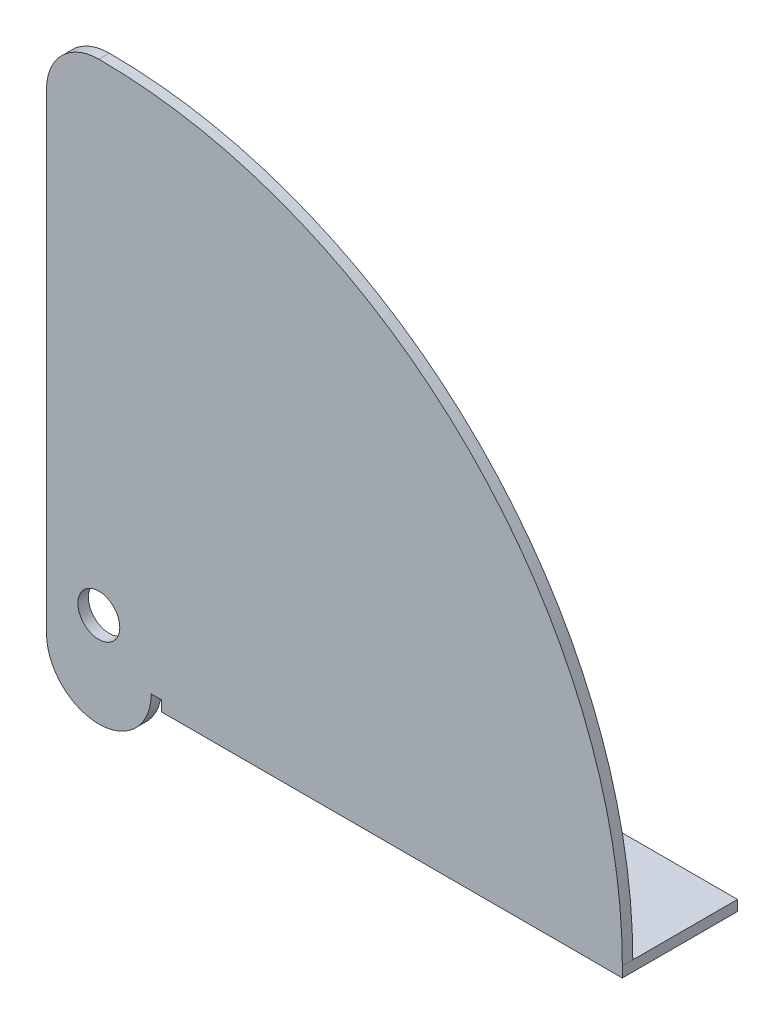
ISO-10303-21;
HEADER;
FILE_DESCRIPTION(('STEP AP214'),'2;1');
FILE_NAME('part.step','',(''),(''),'','','');
FILE_SCHEMA(('AUTOMOTIVE_DESIGN { 1 0 10303 214 1 1 1 1 }'));
ENDSEC;
DATA;
#1=APPLICATION_CONTEXT('core data for automotive mechanical design processes');
#2=APPLICATION_PROTOCOL_DEFINITION('international standard','automotive_design',2000,#1);
#3=PRODUCT_CONTEXT('',#1,'mechanical');
#4=PRODUCT('Part','Part','',(#3));
#5=PRODUCT_RELATED_PRODUCT_CATEGORY('part','',(#4));
#6=PRODUCT_DEFINITION_FORMATION('','',#4);
#7=PRODUCT_DEFINITION_CONTEXT('part definition',#1,'design');
#8=PRODUCT_DEFINITION('design','',#6,#7);
#9=PRODUCT_DEFINITION_SHAPE('','',#8);
#10=(LENGTH_UNIT() NAMED_UNIT(*) SI_UNIT(.MILLI.,.METRE.));
#11=(NAMED_UNIT(*) PLANE_ANGLE_UNIT() SI_UNIT($,.RADIAN.));
#12=(NAMED_UNIT(*) SI_UNIT($,.STERADIAN.) SOLID_ANGLE_UNIT());
#13=UNCERTAINTY_MEASURE_WITH_UNIT(LENGTH_MEASURE(1.E-05),#10,'distance_accuracy_value','');
#14=(GEOMETRIC_REPRESENTATION_CONTEXT(3) GLOBAL_UNCERTAINTY_ASSIGNED_CONTEXT((#13)) GLOBAL_UNIT_ASSIGNED_CONTEXT((#10,
#11,#12)) REPRESENTATION_CONTEXT('',''));
#15=CARTESIAN_POINT('',(0.,0.,0.));
#16=DIRECTION('',(0.,0.,1.));
#17=DIRECTION('',(1.,0.,0.));
#18=AXIS2_PLACEMENT_3D('',#15,#16,#17);
#19=CARTESIAN_POINT('',(5.,0.,1.));
#20=DIRECTION('',(0.,1.,0.));
#21=DIRECTION('',(0.,0.,1.));
#22=AXIS2_PLACEMENT_3D('',#19,#20,#21);
#23=PLANE('',#22);
#24=DIRECTION('',(0.,0.,-1.));
#25=VECTOR('',#24,1.);
#26=CARTESIAN_POINT('',(6.,0.,1.00000000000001));
#27=LINE('',#26,#25);
#28=CARTESIAN_POINT('',(6.,0.,1.00000000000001));
#29=VERTEX_POINT('',#28);
#30=CARTESIAN_POINT('',(6.,0.,0.));
#31=VERTEX_POINT('',#30);
#32=EDGE_CURVE('E106',#29,#31,#27,.T.);
#33=ORIENTED_EDGE('',*,*,#32,.F.);
#34=DIRECTION('',(1.,0.,0.));
#35=VECTOR('',#34,1.);
#36=CARTESIAN_POINT('',(5.,0.,1.));
#37=LINE('',#36,#35);
#38=CARTESIAN_POINT('',(5.,0.,1.));
#39=VERTEX_POINT('',#38);
#40=EDGE_CURVE('E119',#39,#29,#37,.T.);
#41=ORIENTED_EDGE('',*,*,#40,.F.);
#42=DIRECTION('',(0.,0.,-1.));
#43=VECTOR('',#42,1.);
#44=CARTESIAN_POINT('',(5.,0.,1.));
#45=LINE('',#44,#43);
#46=CARTESIAN_POINT('',(5.,0.,0.));
#47=VERTEX_POINT('',#46);
#48=EDGE_CURVE('E139',#39,#47,#45,.T.);
#49=ORIENTED_EDGE('',*,*,#48,.T.);
#50=DIRECTION('',(1.,0.,0.));
#51=VECTOR('',#50,1.);
#52=CARTESIAN_POINT('',(5.,0.,0.));
#53=LINE('',#52,#51);
#54=EDGE_CURVE('E121',#47,#31,#53,.T.);
#55=ORIENTED_EDGE('',*,*,#54,.T.);
#56=EDGE_LOOP('',(#33,#41,#49,#55));
#57=FACE_BOUND('',#56,.T.);
#58=ADVANCED_FACE('F30',(#57),#23,.F.);
#59=CARTESIAN_POINT('',(0.,45.,1.));
#60=DIRECTION('',(0.,0.,1.));
#61=DIRECTION('',(1.,0.,0.));
#62=AXIS2_PLACEMENT_3D('',#59,#60,#61);
#63=PLANE('',#62);
#64=CARTESIAN_POINT('',(0.,45.,1.));
#65=DIRECTION('',(0.,0.,1.));
#66=DIRECTION('',(1.,0.,0.));
#67=AXIS2_PLACEMENT_3D('',#64,#65,#66);
#68=CIRCLE('',#67,5.);
#69=CARTESIAN_POINT('',(0.,50.,1.));
#70=VERTEX_POINT('',#69);
#71=CARTESIAN_POINT('',(-5.,45.,1.));
#72=VERTEX_POINT('',#71);
#73=EDGE_CURVE('E160',#70,#72,#68,.T.);
#74=ORIENTED_EDGE('',*,*,#73,.T.);
#75=DIRECTION('',(0.,-1.,0.));
#76=VECTOR('',#75,1.);
#77=CARTESIAN_POINT('',(-5.,0.,1.));
#78=LINE('',#77,#76);
#79=CARTESIAN_POINT('',(-5.,0.,1.));
#80=VERTEX_POINT('',#79);
#81=EDGE_CURVE('E130',#72,#80,#78,.T.);
#82=ORIENTED_EDGE('',*,*,#81,.T.);
#83=CARTESIAN_POINT('',(0.,0.,1.));
#84=DIRECTION('',(0.,0.,1.));
#85=DIRECTION('',(1.,0.,0.));
#86=AXIS2_PLACEMENT_3D('',#83,#84,#85);
#87=CIRCLE('',#86,5.);
#88=EDGE_CURVE('E52',#80,#39,#87,.T.);
#89=ORIENTED_EDGE('',*,*,#88,.T.);
#90=ORIENTED_EDGE('',*,*,#40,.T.);
#91=DIRECTION('',(0.,1.,0.));
#92=VECTOR('',#91,1.);
#93=CARTESIAN_POINT('',(6.,-1.,1.00000000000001));
#94=LINE('',#93,#92);
#95=CARTESIAN_POINT('',(6.,-1.,1.00000000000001));
#96=VERTEX_POINT('',#95);
#97=EDGE_CURVE('E103',#96,#29,#94,.T.);
#98=ORIENTED_EDGE('',*,*,#97,.F.);
#99=DIRECTION('',(-1.,0.,0.));
#100=VECTOR('',#99,1.);
#101=CARTESIAN_POINT('',(50.,-1.,1.));
#102=LINE('',#101,#100);
#103=CARTESIAN_POINT('',(50.,-1.,1.));
#104=VERTEX_POINT('',#103);
#105=EDGE_CURVE('E188',#104,#96,#102,.T.);
#106=ORIENTED_EDGE('',*,*,#105,.F.);
#107=DIRECTION('',(0.,1.,0.));
#108=VECTOR('',#107,1.);
#109=CARTESIAN_POINT('',(50.,-1.,1.));
#110=LINE('',#109,#108);
#111=CARTESIAN_POINT('',(50.,0.,1.));
#112=VERTEX_POINT('',#111);
#113=EDGE_CURVE('E181',#104,#112,#110,.T.);
#114=ORIENTED_EDGE('',*,*,#113,.T.);
#115=CARTESIAN_POINT('',(0.,0.,1.));
#116=DIRECTION('',(0.,0.,1.));
#117=DIRECTION('',(1.,0.,0.));
#118=AXIS2_PLACEMENT_3D('',#115,#116,#117);
#119=CIRCLE('',#118,50.);
#120=EDGE_CURVE('E45',#112,#70,#119,.T.);
#121=ORIENTED_EDGE('',*,*,#120,.T.);
#122=EDGE_LOOP('',(#74,#82,#89,#90,#98,#106,#114,#121));
#123=FACE_BOUND('',#122,.T.);
#124=CARTESIAN_POINT('',(0.,4.,1.));
#125=DIRECTION('',(0.,0.,1.));
#126=DIRECTION('',(1.,0.,0.));
#127=AXIS2_PLACEMENT_3D('',#124,#125,#126);
#128=CIRCLE('',#127,2.);
#129=CARTESIAN_POINT('',(2.,4.,1.));
#130=VERTEX_POINT('',#129);
#131=EDGE_CURVE('E167',#130,#130,#128,.T.);
#132=ORIENTED_EDGE('',*,*,#131,.F.);
#133=EDGE_LOOP('',(#132));
#134=FACE_BOUND('',#133,.T.);
#135=ADVANCED_FACE('F125',(#123,#134),#63,.T.);
#136=CARTESIAN_POINT('',(0.,45.,0.));
#137=DIRECTION('',(0.,0.,1.));
#138=DIRECTION('',(1.,0.,0.));
#139=AXIS2_PLACEMENT_3D('',#136,#137,#138);
#140=PLANE('',#139);
#141=CARTESIAN_POINT('',(0.,45.,0.));
#142=DIRECTION('',(0.,0.,1.));
#143=DIRECTION('',(1.,0.,0.));
#144=AXIS2_PLACEMENT_3D('',#141,#142,#143);
#145=CIRCLE('',#144,5.);
#146=CARTESIAN_POINT('',(0.,50.,0.));
#147=VERTEX_POINT('',#146);
#148=CARTESIAN_POINT('',(-5.,45.,0.));
#149=VERTEX_POINT('',#148);
#150=EDGE_CURVE('E155',#147,#149,#145,.T.);
#151=ORIENTED_EDGE('',*,*,#150,.F.);
#152=CARTESIAN_POINT('',(0.,0.,0.));
#153=DIRECTION('',(0.,0.,1.));
#154=DIRECTION('',(1.,0.,0.));
#155=AXIS2_PLACEMENT_3D('',#152,#153,#154);
#156=CIRCLE('',#155,50.);
#157=CARTESIAN_POINT('',(50.,0.,0.));
#158=VERTEX_POINT('',#157);
#159=EDGE_CURVE('E153',#158,#147,#156,.T.);
#160=ORIENTED_EDGE('',*,*,#159,.F.);
#161=DIRECTION('',(1.,0.,0.));
#162=VECTOR('',#161,1.);
#163=CARTESIAN_POINT('',(0.,0.,0.));
#164=LINE('',#163,#162);
#165=EDGE_CURVE('E112',#31,#158,#164,.T.);
#166=ORIENTED_EDGE('',*,*,#165,.F.);
#167=ORIENTED_EDGE('',*,*,#54,.F.);
#168=CARTESIAN_POINT('',(0.,0.,0.));
#169=DIRECTION('',(0.,0.,1.));
#170=DIRECTION('',(1.,0.,0.));
#171=AXIS2_PLACEMENT_3D('',#168,#169,#170);
#172=CIRCLE('',#171,5.);
#173=CARTESIAN_POINT('',(-5.,0.,0.));
#174=VERTEX_POINT('',#173);
#175=EDGE_CURVE('E145',#174,#47,#172,.T.);
#176=ORIENTED_EDGE('',*,*,#175,.F.);
#177=DIRECTION('',(0.,-1.,0.));
#178=VECTOR('',#177,1.);
#179=CARTESIAN_POINT('',(-5.,0.,0.));
#180=LINE('',#179,#178);
#181=EDGE_CURVE('E151',#149,#174,#180,.T.);
#182=ORIENTED_EDGE('',*,*,#181,.F.);
#183=EDGE_LOOP('',(#151,#160,#166,#167,#176,#182));
#184=FACE_BOUND('',#183,.T.);
#185=CARTESIAN_POINT('',(0.,4.,0.));
#186=DIRECTION('',(0.,0.,1.));
#187=DIRECTION('',(1.,0.,0.));
#188=AXIS2_PLACEMENT_3D('',#185,#186,#187);
#189=CIRCLE('',#188,2.);
#190=CARTESIAN_POINT('',(2.,4.,0.));
#191=VERTEX_POINT('',#190);
#192=EDGE_CURVE('E169',#191,#191,#189,.T.);
#193=ORIENTED_EDGE('',*,*,#192,.T.);
#194=EDGE_LOOP('',(#193));
#195=FACE_BOUND('',#194,.T.);
#196=ADVANCED_FACE('F149',(#184,#195),#140,.F.);
#197=CARTESIAN_POINT('',(0.,45.,1.));
#198=DIRECTION('',(0.,0.,-1.));
#199=DIRECTION('',(-1.,0.,0.));
#200=AXIS2_PLACEMENT_3D('',#197,#198,#199);
#201=CYLINDRICAL_SURFACE('',#200,5.);
#202=ORIENTED_EDGE('',*,*,#150,.T.);
#203=DIRECTION('',(0.,0.,-1.));
#204=VECTOR('',#203,1.);
#205=CARTESIAN_POINT('',(-5.,45.,1.));
#206=LINE('',#205,#204);
#207=EDGE_CURVE('E11',#72,#149,#206,.T.);
#208=ORIENTED_EDGE('',*,*,#207,.F.);
#209=ORIENTED_EDGE('',*,*,#73,.F.);
#210=DIRECTION('',(0.,0.,-1.));
#211=VECTOR('',#210,1.);
#212=CARTESIAN_POINT('',(0.,50.,1.));
#213=LINE('',#212,#211);
#214=EDGE_CURVE('E128',#70,#147,#213,.T.);
#215=ORIENTED_EDGE('',*,*,#214,.T.);
#216=EDGE_LOOP('',(#202,#208,#209,#215));
#217=FACE_BOUND('',#216,.T.);
#218=ADVANCED_FACE('F32',(#217),#201,.T.);
#219=CARTESIAN_POINT('',(-5.,0.,1.));
#220=DIRECTION('',(1.,0.,0.));
#221=DIRECTION('',(0.,0.,-1.));
#222=AXIS2_PLACEMENT_3D('',#219,#220,#221);
#223=PLANE('',#222);
#224=ORIENTED_EDGE('',*,*,#181,.T.);
#225=DIRECTION('',(0.,0.,-1.));
#226=VECTOR('',#225,1.);
#227=CARTESIAN_POINT('',(-5.,0.,1.));
#228=LINE('',#227,#226);
#229=EDGE_CURVE('E38',#80,#174,#228,.T.);
#230=ORIENTED_EDGE('',*,*,#229,.F.);
#231=ORIENTED_EDGE('',*,*,#81,.F.);
#232=ORIENTED_EDGE('',*,*,#207,.T.);
#233=EDGE_LOOP('',(#224,#230,#231,#232));
#234=FACE_BOUND('',#233,.T.);
#235=ADVANCED_FACE('F163',(#234),#223,.F.);
#236=CARTESIAN_POINT('',(0.,0.,1.));
#237=DIRECTION('',(0.,0.,-1.));
#238=DIRECTION('',(-1.,0.,0.));
#239=AXIS2_PLACEMENT_3D('',#236,#237,#238);
#240=CYLINDRICAL_SURFACE('',#239,5.);
#241=ORIENTED_EDGE('',*,*,#175,.T.);
#242=ORIENTED_EDGE('',*,*,#48,.F.);
#243=ORIENTED_EDGE('',*,*,#88,.F.);
#244=ORIENTED_EDGE('',*,*,#229,.T.);
#245=EDGE_LOOP('',(#241,#242,#243,#244));
#246=FACE_BOUND('',#245,.T.);
#247=ADVANCED_FACE('F144',(#246),#240,.T.);
#248=CARTESIAN_POINT('',(0.,0.,1.));
#249=DIRECTION('',(0.,0.,-1.));
#250=DIRECTION('',(-1.,0.,0.));
#251=AXIS2_PLACEMENT_3D('',#248,#249,#250);
#252=CYLINDRICAL_SURFACE('',#251,50.);
#253=ORIENTED_EDGE('',*,*,#159,.T.);
#254=ORIENTED_EDGE('',*,*,#214,.F.);
#255=ORIENTED_EDGE('',*,*,#120,.F.);
#256=DIRECTION('',(0.,0.,-1.));
#257=VECTOR('',#256,1.);
#258=CARTESIAN_POINT('',(50.,0.,1.));
#259=LINE('',#258,#257);
#260=EDGE_CURVE('E136',#112,#158,#259,.T.);
#261=ORIENTED_EDGE('',*,*,#260,.T.);
#262=EDGE_LOOP('',(#253,#254,#255,#261));
#263=FACE_BOUND('',#262,.T.);
#264=ADVANCED_FACE('F228',(#263),#252,.T.);
#265=CARTESIAN_POINT('',(0.,4.,1.));
#266=DIRECTION('',(0.,0.,-1.));
#267=DIRECTION('',(-1.,0.,0.));
#268=AXIS2_PLACEMENT_3D('',#265,#266,#267);
#269=CYLINDRICAL_SURFACE('',#268,2.);
#270=ORIENTED_EDGE('',*,*,#131,.T.);
#271=EDGE_LOOP('',(#270));
#272=FACE_BOUND('',#271,.T.);
#273=ORIENTED_EDGE('',*,*,#192,.F.);
#274=EDGE_LOOP('',(#273));
#275=FACE_BOUND('',#274,.T.);
#276=ADVANCED_FACE('F241',(#272,#275),#269,.F.);
#277=CARTESIAN_POINT('',(6.,0.,1.00000000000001));
#278=DIRECTION('',(0.,-1.,0.));
#279=DIRECTION('',(0.,0.,-1.));
#280=AXIS2_PLACEMENT_3D('',#277,#278,#279);
#281=PLANE('',#280);
#282=CARTESIAN_POINT('',(40.,0.,-5.));
#283=DIRECTION('',(0.,-1.,0.));
#284=DIRECTION('',(0.,0.,1.));
#285=AXIS2_PLACEMENT_3D('',#282,#283,#284);
#286=CIRCLE('',#285,1.75);
#287=CARTESIAN_POINT('',(40.,0.,-3.25));
#288=VERTEX_POINT('',#287);
#289=EDGE_CURVE('E202',#288,#288,#286,.T.);
#290=ORIENTED_EDGE('',*,*,#289,.T.);
#291=EDGE_LOOP('',(#290));
#292=FACE_BOUND('',#291,.T.);
#293=CARTESIAN_POINT('',(16.,0.,-5.));
#294=DIRECTION('',(0.,-1.,0.));
#295=DIRECTION('',(0.,0.,1.));
#296=AXIS2_PLACEMENT_3D('',#293,#294,#295);
#297=CIRCLE('',#296,1.75);
#298=CARTESIAN_POINT('',(16.,0.,-3.25));
#299=VERTEX_POINT('',#298);
#300=EDGE_CURVE('E196',#299,#299,#297,.T.);
#301=ORIENTED_EDGE('',*,*,#300,.T.);
#302=EDGE_LOOP('',(#301));
#303=FACE_BOUND('',#302,.T.);
#304=CARTESIAN_POINT('',(6.,0.,-9.99999999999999));
#305=VERTEX_POINT('',#304);
#306=EDGE_CURVE('E123',#31,#305,#27,.T.);
#307=ORIENTED_EDGE('',*,*,#306,.F.);
#308=ORIENTED_EDGE('',*,*,#165,.T.);
#309=DIRECTION('',(0.,0.,1.));
#310=VECTOR('',#309,1.);
#311=CARTESIAN_POINT('',(50.,0.,1.));
#312=LINE('',#311,#310);
#313=CARTESIAN_POINT('',(50.,0.,-10.));
#314=VERTEX_POINT('',#313);
#315=EDGE_CURVE('E190',#314,#158,#312,.T.);
#316=ORIENTED_EDGE('',*,*,#315,.F.);
#317=DIRECTION('',(1.,0.,0.));
#318=VECTOR('',#317,1.);
#319=CARTESIAN_POINT('',(50.,0.,-10.));
#320=LINE('',#319,#318);
#321=EDGE_CURVE('E122',#305,#314,#320,.T.);
#322=ORIENTED_EDGE('',*,*,#321,.F.);
#323=EDGE_LOOP('',(#307,#308,#316,#322));
#324=FACE_BOUND('',#323,.T.);
#325=ADVANCED_FACE('F206',(#292,#303,#324),#281,.F.);
#326=CARTESIAN_POINT('',(6.,-1.,1.00000000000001));
#327=DIRECTION('',(0.,-1.,0.));
#328=DIRECTION('',(0.,0.,-1.));
#329=AXIS2_PLACEMENT_3D('',#326,#327,#328);
#330=PLANE('',#329);
#331=CARTESIAN_POINT('',(16.,-1.,-5.));
#332=DIRECTION('',(0.,-1.,0.));
#333=DIRECTION('',(0.,0.,1.));
#334=AXIS2_PLACEMENT_3D('',#331,#332,#333);
#335=CIRCLE('',#334,1.75);
#336=CARTESIAN_POINT('',(16.,-1.,-3.25));
#337=VERTEX_POINT('',#336);
#338=EDGE_CURVE('E193',#337,#337,#335,.T.);
#339=ORIENTED_EDGE('',*,*,#338,.F.);
#340=EDGE_LOOP('',(#339));
#341=FACE_BOUND('',#340,.T.);
#342=ORIENTED_EDGE('',*,*,#105,.T.);
#343=DIRECTION('',(0.,0.,-1.));
#344=VECTOR('',#343,1.);
#345=CARTESIAN_POINT('',(6.,-1.,1.00000000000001));
#346=LINE('',#345,#344);
#347=CARTESIAN_POINT('',(6.,-1.,-9.99999999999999));
#348=VERTEX_POINT('',#347);
#349=EDGE_CURVE('E109',#96,#348,#346,.T.);
#350=ORIENTED_EDGE('',*,*,#349,.T.);
#351=DIRECTION('',(1.,0.,0.));
#352=VECTOR('',#351,1.);
#353=CARTESIAN_POINT('',(50.,-1.,-10.));
#354=LINE('',#353,#352);
#355=CARTESIAN_POINT('',(50.,-1.,-10.));
#356=VERTEX_POINT('',#355);
#357=EDGE_CURVE('E185',#348,#356,#354,.T.);
#358=ORIENTED_EDGE('',*,*,#357,.T.);
#359=DIRECTION('',(0.,0.,1.));
#360=VECTOR('',#359,1.);
#361=CARTESIAN_POINT('',(50.,-1.,1.));
#362=LINE('',#361,#360);
#363=EDGE_CURVE('E183',#356,#104,#362,.T.);
#364=ORIENTED_EDGE('',*,*,#363,.T.);
#365=EDGE_LOOP('',(#342,#350,#358,#364));
#366=FACE_BOUND('',#365,.T.);
#367=CARTESIAN_POINT('',(40.,-1.,-5.));
#368=DIRECTION('',(0.,-1.,0.));
#369=DIRECTION('',(0.,0.,1.));
#370=AXIS2_PLACEMENT_3D('',#367,#368,#369);
#371=CIRCLE('',#370,1.75);
#372=CARTESIAN_POINT('',(40.,-1.,-3.25));
#373=VERTEX_POINT('',#372);
#374=EDGE_CURVE('E199',#373,#373,#371,.T.);
#375=ORIENTED_EDGE('',*,*,#374,.F.);
#376=EDGE_LOOP('',(#375));
#377=FACE_BOUND('',#376,.T.);
#378=ADVANCED_FACE('F248',(#341,#366,#377),#330,.T.);
#379=CARTESIAN_POINT('',(6.,-1.,1.00000000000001));
#380=DIRECTION('',(1.,0.,0.));
#381=DIRECTION('',(0.,0.,-1.));
#382=AXIS2_PLACEMENT_3D('',#379,#380,#381);
#383=PLANE('',#382);
#384=ORIENTED_EDGE('',*,*,#32,.T.);
#385=ORIENTED_EDGE('',*,*,#306,.T.);
#386=DIRECTION('',(0.,1.,0.));
#387=VECTOR('',#386,1.);
#388=CARTESIAN_POINT('',(6.,-1.,-9.99999999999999));
#389=LINE('',#388,#387);
#390=EDGE_CURVE('E113',#348,#305,#389,.T.);
#391=ORIENTED_EDGE('',*,*,#390,.F.);
#392=ORIENTED_EDGE('',*,*,#349,.F.);
#393=ORIENTED_EDGE('',*,*,#97,.T.);
#394=EDGE_LOOP('',(#384,#385,#391,#392,#393));
#395=FACE_BOUND('',#394,.T.);
#396=ADVANCED_FACE('F105',(#395),#383,.F.);
#397=CARTESIAN_POINT('',(50.,-1.,-10.));
#398=DIRECTION('',(0.,0.,1.));
#399=DIRECTION('',(1.,0.,0.));
#400=AXIS2_PLACEMENT_3D('',#397,#398,#399);
#401=PLANE('',#400);
#402=ORIENTED_EDGE('',*,*,#321,.T.);
#403=DIRECTION('',(0.,1.,0.));
#404=VECTOR('',#403,1.);
#405=CARTESIAN_POINT('',(50.,-1.,-10.));
#406=LINE('',#405,#404);
#407=EDGE_CURVE('E178',#356,#314,#406,.T.);
#408=ORIENTED_EDGE('',*,*,#407,.F.);
#409=ORIENTED_EDGE('',*,*,#357,.F.);
#410=ORIENTED_EDGE('',*,*,#390,.T.);
#411=EDGE_LOOP('',(#402,#408,#409,#410));
#412=FACE_BOUND('',#411,.T.);
#413=ADVANCED_FACE('F247',(#412),#401,.F.);
#414=CARTESIAN_POINT('',(50.,-1.,1.));
#415=DIRECTION('',(-1.,0.,0.));
#416=DIRECTION('',(0.,0.,1.));
#417=AXIS2_PLACEMENT_3D('',#414,#415,#416);
#418=PLANE('',#417);
#419=ORIENTED_EDGE('',*,*,#315,.T.);
#420=ORIENTED_EDGE('',*,*,#260,.F.);
#421=ORIENTED_EDGE('',*,*,#113,.F.);
#422=ORIENTED_EDGE('',*,*,#363,.F.);
#423=ORIENTED_EDGE('',*,*,#407,.T.);
#424=EDGE_LOOP('',(#419,#420,#421,#422,#423));
#425=FACE_BOUND('',#424,.T.);
#426=ADVANCED_FACE('F217',(#425),#418,.F.);
#427=CARTESIAN_POINT('',(16.,-1.,-5.));
#428=DIRECTION('',(0.,1.,0.));
#429=DIRECTION('',(0.,0.,1.));
#430=AXIS2_PLACEMENT_3D('',#427,#428,#429);
#431=CYLINDRICAL_SURFACE('',#430,1.75);
#432=ORIENTED_EDGE('',*,*,#338,.T.);
#433=EDGE_LOOP('',(#432));
#434=FACE_BOUND('',#433,.T.);
#435=ORIENTED_EDGE('',*,*,#300,.F.);
#436=EDGE_LOOP('',(#435));
#437=FACE_BOUND('',#436,.T.);
#438=ADVANCED_FACE('F211',(#434,#437),#431,.F.);
#439=CARTESIAN_POINT('',(40.,-1.,-5.));
#440=DIRECTION('',(0.,1.,0.));
#441=DIRECTION('',(0.,0.,1.));
#442=AXIS2_PLACEMENT_3D('',#439,#440,#441);
#443=CYLINDRICAL_SURFACE('',#442,1.75);
#444=ORIENTED_EDGE('',*,*,#374,.T.);
#445=EDGE_LOOP('',(#444));
#446=FACE_BOUND('',#445,.T.);
#447=ORIENTED_EDGE('',*,*,#289,.F.);
#448=EDGE_LOOP('',(#447));
#449=FACE_BOUND('',#448,.T.);
#450=ADVANCED_FACE('F209',(#446,#449),#443,.F.);
#451=CLOSED_SHELL('',(#58,#135,#196,#218,#235,#247,#264,#276,#325,#378,#396,#413,#426,#438,#450));
#452=MANIFOLD_SOLID_BREP('B2',#451);
#453=ADVANCED_BREP_SHAPE_REPRESENTATION('',(#18,#452),#14);
#454=SHAPE_DEFINITION_REPRESENTATION(#9,#453);
ENDSEC;
END-ISO-10303-21;
